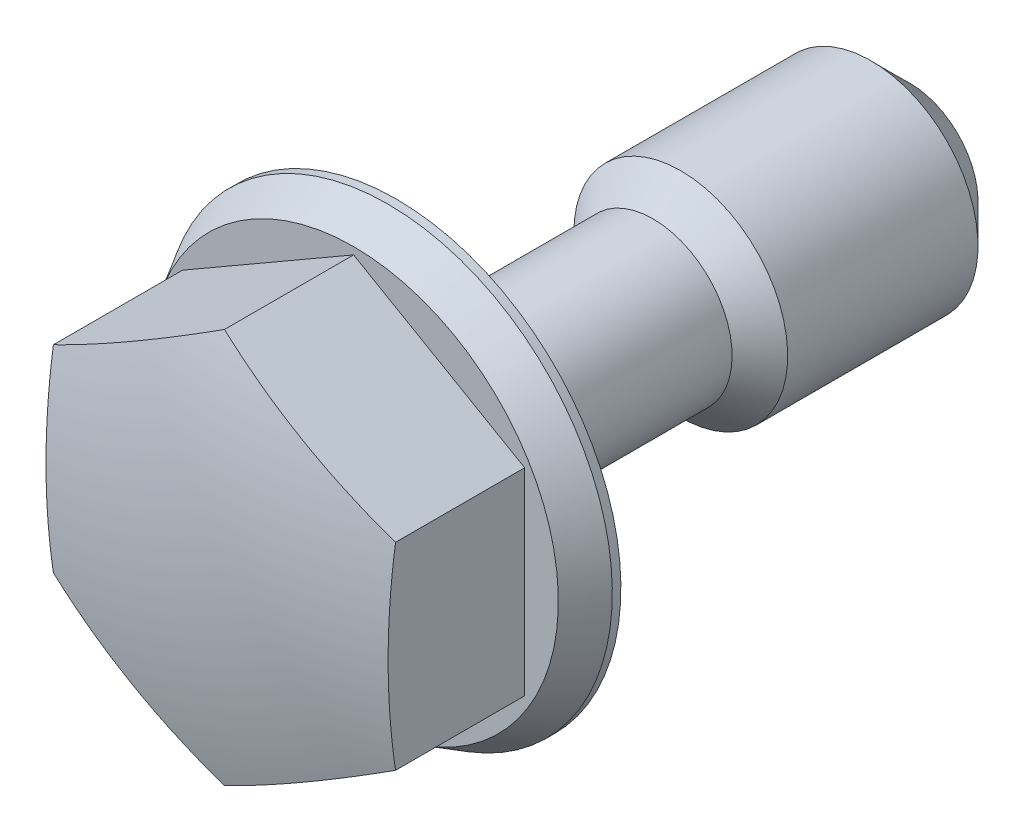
ISO-10303-21;
HEADER;
FILE_DESCRIPTION(('STEP AP214'),'2;1');
FILE_NAME('part.step','',(''),(''),'','','');
FILE_SCHEMA(('AUTOMOTIVE_DESIGN { 1 0 10303 214 1 1 1 1 }'));
ENDSEC;
DATA;
#1=APPLICATION_CONTEXT('core data for automotive mechanical design processes');
#2=APPLICATION_PROTOCOL_DEFINITION('international standard','automotive_design',2000,#1);
#3=PRODUCT_CONTEXT('',#1,'mechanical');
#4=PRODUCT('Part','Part','',(#3));
#5=PRODUCT_RELATED_PRODUCT_CATEGORY('part','',(#4));
#6=PRODUCT_DEFINITION_FORMATION('','',#4);
#7=PRODUCT_DEFINITION_CONTEXT('part definition',#1,'design');
#8=PRODUCT_DEFINITION('design','',#6,#7);
#9=PRODUCT_DEFINITION_SHAPE('','',#8);
#10=(LENGTH_UNIT() NAMED_UNIT(*) SI_UNIT(.MILLI.,.METRE.));
#11=(NAMED_UNIT(*) PLANE_ANGLE_UNIT() SI_UNIT($,.RADIAN.));
#12=(NAMED_UNIT(*) SI_UNIT($,.STERADIAN.) SOLID_ANGLE_UNIT());
#13=UNCERTAINTY_MEASURE_WITH_UNIT(LENGTH_MEASURE(1.E-05),#10,'distance_accuracy_value','');
#14=(GEOMETRIC_REPRESENTATION_CONTEXT(3) GLOBAL_UNCERTAINTY_ASSIGNED_CONTEXT((#13)) GLOBAL_UNIT_ASSIGNED_CONTEXT((#10,
#11,#12)) REPRESENTATION_CONTEXT('',''));
#15=CARTESIAN_POINT('',(0.,0.,0.));
#16=DIRECTION('',(0.,0.,1.));
#17=DIRECTION('',(1.,0.,0.));
#18=AXIS2_PLACEMENT_3D('',#15,#16,#17);
#19=CARTESIAN_POINT('',(0.,0.,1.));
#20=DIRECTION('',(0.,0.,-1.));
#21=DIRECTION('',(0.,1.,0.));
#22=AXIS2_PLACEMENT_3D('',#19,#20,#21);
#23=CONICAL_SURFACE('',#22,4.7881197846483,0.523598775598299);
#24=CARTESIAN_POINT('',(0.,0.,0.2));
#25=DIRECTION('',(0.,0.,-1.));
#26=DIRECTION('',(0.,1.,0.));
#27=AXIS2_PLACEMENT_3D('',#24,#25,#26);
#28=CIRCLE('',#27,5.25);
#29=CARTESIAN_POINT('',(0.,5.25,0.2));
#30=VERTEX_POINT('',#29);
#31=EDGE_CURVE('E117',#30,#30,#28,.T.);
#32=ORIENTED_EDGE('',*,*,#31,.F.);
#33=EDGE_LOOP('',(#32));
#34=FACE_BOUND('',#33,.T.);
#35=CARTESIAN_POINT('',(0.,0.,1.));
#36=DIRECTION('',(0.,0.,1.));
#37=DIRECTION('',(0.,-1.,0.));
#38=AXIS2_PLACEMENT_3D('',#35,#36,#37);
#39=CIRCLE('',#38,4.7881197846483);
#40=CARTESIAN_POINT('',(0.,-4.7881197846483,1.));
#41=VERTEX_POINT('',#40);
#42=EDGE_CURVE('E95',#41,#41,#39,.T.);
#43=ORIENTED_EDGE('',*,*,#42,.F.);
#44=EDGE_LOOP('',(#43));
#45=FACE_BOUND('',#44,.T.);
#46=ADVANCED_FACE('F14',(#34,#45),#23,.T.);
#47=CARTESIAN_POINT('',(0.,0.,-12.));
#48=DIRECTION('',(0.,0.,-1.));
#49=DIRECTION('',(0.,1.,0.));
#50=AXIS2_PLACEMENT_3D('',#47,#48,#49);
#51=CYLINDRICAL_SURFACE('',#50,5.25);
#52=CARTESIAN_POINT('',(0.,0.,0.));
#53=DIRECTION('',(0.,0.,-1.));
#54=DIRECTION('',(0.,1.,0.));
#55=AXIS2_PLACEMENT_3D('',#52,#53,#54);
#56=CIRCLE('',#55,5.25);
#57=CARTESIAN_POINT('',(0.,5.25,0.));
#58=VERTEX_POINT('',#57);
#59=EDGE_CURVE('E114',#58,#58,#56,.T.);
#60=ORIENTED_EDGE('',*,*,#59,.F.);
#61=EDGE_LOOP('',(#60));
#62=FACE_BOUND('',#61,.T.);
#63=ORIENTED_EDGE('',*,*,#31,.T.);
#64=EDGE_LOOP('',(#63));
#65=FACE_BOUND('',#64,.T.);
#66=ADVANCED_FACE('F150',(#62,#65),#51,.T.);
#67=CARTESIAN_POINT('',(5.25,0.,0.));
#68=DIRECTION('',(0.,0.,1.));
#69=DIRECTION('',(0.,-1.,0.));
#70=AXIS2_PLACEMENT_3D('',#67,#68,#69);
#71=PLANE('',#70);
#72=CARTESIAN_POINT('',(0.,0.,0.));
#73=DIRECTION('',(0.,0.,-1.));
#74=DIRECTION('',(0.,1.,0.));
#75=AXIS2_PLACEMENT_3D('',#72,#73,#74);
#76=CIRCLE('',#75,2.45);
#77=CARTESIAN_POINT('',(0.,2.45,0.));
#78=VERTEX_POINT('',#77);
#79=EDGE_CURVE('E111',#78,#78,#76,.T.);
#80=ORIENTED_EDGE('',*,*,#79,.F.);
#81=EDGE_LOOP('',(#80));
#82=FACE_BOUND('',#81,.T.);
#83=ORIENTED_EDGE('',*,*,#59,.T.);
#84=EDGE_LOOP('',(#83));
#85=FACE_BOUND('',#84,.T.);
#86=ADVANCED_FACE('F156',(#82,#85),#71,.F.);
#87=CARTESIAN_POINT('',(0.,0.,-0.6));
#88=DIRECTION('',(0.,0.,-1.));
#89=DIRECTION('',(0.,1.,0.));
#90=AXIS2_PLACEMENT_3D('',#87,#88,#89);
#91=TOROIDAL_SURFACE('',#90,2.45,0.6);
#92=CARTESIAN_POINT('',(0.,0.,-0.6));
#93=DIRECTION('',(0.,0.,-1.));
#94=DIRECTION('',(0.,1.,0.));
#95=AXIS2_PLACEMENT_3D('',#92,#93,#94);
#96=CIRCLE('',#95,1.85);
#97=CARTESIAN_POINT('',(0.,1.85,-0.6));
#98=VERTEX_POINT('',#97);
#99=EDGE_CURVE('E108',#98,#98,#96,.T.);
#100=ORIENTED_EDGE('',*,*,#99,.F.);
#101=EDGE_LOOP('',(#100));
#102=FACE_BOUND('',#101,.T.);
#103=ORIENTED_EDGE('',*,*,#79,.T.);
#104=EDGE_LOOP('',(#103));
#105=FACE_BOUND('',#104,.T.);
#106=ADVANCED_FACE('F215',(#102,#105),#91,.F.);
#107=CARTESIAN_POINT('',(0.,0.,-12.));
#108=DIRECTION('',(0.,0.,-1.));
#109=DIRECTION('',(0.,1.,0.));
#110=AXIS2_PLACEMENT_3D('',#107,#108,#109);
#111=CYLINDRICAL_SURFACE('',#110,1.85);
#112=CARTESIAN_POINT('',(0.,0.,-6.));
#113=DIRECTION('',(0.,0.,-1.));
#114=DIRECTION('',(0.,1.,0.));
#115=AXIS2_PLACEMENT_3D('',#112,#113,#114);
#116=CIRCLE('',#115,1.85);
#117=CARTESIAN_POINT('',(0.,1.85,-6.));
#118=VERTEX_POINT('',#117);
#119=EDGE_CURVE('E83',#118,#118,#116,.T.);
#120=ORIENTED_EDGE('',*,*,#119,.F.);
#121=EDGE_LOOP('',(#120));
#122=FACE_BOUND('',#121,.T.);
#123=ORIENTED_EDGE('',*,*,#99,.T.);
#124=EDGE_LOOP('',(#123));
#125=FACE_BOUND('',#124,.T.);
#126=ADVANCED_FACE('F212',(#122,#125),#111,.T.);
#127=CARTESIAN_POINT('',(0.,0.,1.));
#128=DIRECTION('',(0.,0.,1.));
#129=DIRECTION('',(0.,-1.,0.));
#130=AXIS2_PLACEMENT_3D('',#127,#128,#129);
#131=PLANE('',#130);
#132=DIRECTION('',(0.,-1.,0.));
#133=VECTOR('',#132,1.);
#134=CARTESIAN_POINT('',(-4.,2.30940107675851,1.));
#135=LINE('',#134,#133);
#136=CARTESIAN_POINT('',(-4.,2.30940107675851,1.));
#137=VERTEX_POINT('',#136);
#138=CARTESIAN_POINT('',(-4.,-2.30940107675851,1.));
#139=VERTEX_POINT('',#138);
#140=EDGE_CURVE('E72',#137,#139,#135,.T.);
#141=ORIENTED_EDGE('',*,*,#140,.F.);
#142=DIRECTION('',(-0.866025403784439,-0.5,0.));
#143=VECTOR('',#142,1.);
#144=CARTESIAN_POINT('',(0.,4.61880215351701,1.));
#145=LINE('',#144,#143);
#146=CARTESIAN_POINT('',(0.,4.61880215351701,1.));
#147=VERTEX_POINT('',#146);
#148=EDGE_CURVE('E88',#147,#137,#145,.T.);
#149=ORIENTED_EDGE('',*,*,#148,.F.);
#150=DIRECTION('',(-0.866025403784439,0.5,0.));
#151=VECTOR('',#150,1.);
#152=CARTESIAN_POINT('',(4.,2.30940107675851,1.));
#153=LINE('',#152,#151);
#154=CARTESIAN_POINT('',(4.,2.30940107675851,1.));
#155=VERTEX_POINT('',#154);
#156=EDGE_CURVE('E90',#155,#147,#153,.T.);
#157=ORIENTED_EDGE('',*,*,#156,.F.);
#158=DIRECTION('',(0.,1.,0.));
#159=VECTOR('',#158,1.);
#160=CARTESIAN_POINT('',(4.,-2.30940107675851,1.));
#161=LINE('',#160,#159);
#162=CARTESIAN_POINT('',(4.,-2.30940107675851,1.));
#163=VERTEX_POINT('',#162);
#164=EDGE_CURVE('E183',#163,#155,#161,.T.);
#165=ORIENTED_EDGE('',*,*,#164,.F.);
#166=DIRECTION('',(0.866025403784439,0.5,0.));
#167=VECTOR('',#166,1.);
#168=CARTESIAN_POINT('',(0.,-4.61880215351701,1.));
#169=LINE('',#168,#167);
#170=CARTESIAN_POINT('',(0.,-4.61880215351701,1.));
#171=VERTEX_POINT('',#170);
#172=EDGE_CURVE('E82',#171,#163,#169,.T.);
#173=ORIENTED_EDGE('',*,*,#172,.F.);
#174=DIRECTION('',(0.866025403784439,-0.5,0.));
#175=VECTOR('',#174,1.);
#176=CARTESIAN_POINT('',(-4.,-2.30940107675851,1.));
#177=LINE('',#176,#175);
#178=EDGE_CURVE('E68',#139,#171,#177,.T.);
#179=ORIENTED_EDGE('',*,*,#178,.F.);
#180=EDGE_LOOP('',(#141,#149,#157,#165,#173,#179));
#181=FACE_BOUND('',#180,.T.);
#182=ORIENTED_EDGE('',*,*,#42,.T.);
#183=EDGE_LOOP('',(#182));
#184=FACE_BOUND('',#183,.T.);
#185=ADVANCED_FACE('F77',(#181,#184),#131,.T.);
#186=CARTESIAN_POINT('',(-4.,2.30940107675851,1.));
#187=DIRECTION('',(-1.,0.,0.));
#188=DIRECTION('',(0.,-1.,0.));
#189=AXIS2_PLACEMENT_3D('',#186,#187,#188);
#190=PLANE('',#189);
#191=DIRECTION('',(0.,0.,1.));
#192=VECTOR('',#191,1.);
#193=CARTESIAN_POINT('',(-4.,2.30940107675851,1.));
#194=LINE('',#193,#192);
#195=CARTESIAN_POINT('',(-4.,2.30940107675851,4.0188337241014));
#196=VERTEX_POINT('',#195);
#197=EDGE_CURVE('E86',#137,#196,#194,.T.);
#198=ORIENTED_EDGE('',*,*,#197,.F.);
#199=ORIENTED_EDGE('',*,*,#140,.T.);
#200=DIRECTION('',(0.,0.,1.));
#201=VECTOR('',#200,1.);
#202=CARTESIAN_POINT('',(-4.,-2.30940107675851,1.));
#203=LINE('',#202,#201);
#204=CARTESIAN_POINT('',(-4.,-2.30940107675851,4.0188337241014));
#205=VERTEX_POINT('',#204);
#206=EDGE_CURVE('E65',#139,#205,#203,.T.);
#207=ORIENTED_EDGE('',*,*,#206,.T.);
#208=CARTESIAN_POINT('',(-4.,0.,-11.3));
#209=DIRECTION('',(-1.,0.,0.));
#210=DIRECTION('',(0.,-1.,0.));
#211=AXIS2_PLACEMENT_3D('',#208,#209,#210);
#212=CIRCLE('',#211,15.4919333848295);
#213=EDGE_CURVE('E37',#196,#205,#212,.F.);
#214=ORIENTED_EDGE('',*,*,#213,.F.);
#215=EDGE_LOOP('',(#198,#199,#207,#214));
#216=FACE_BOUND('',#215,.T.);
#217=ADVANCED_FACE('F85',(#216),#190,.T.);
#218=CARTESIAN_POINT('',(0.,4.61880215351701,1.));
#219=DIRECTION('',(-0.5,0.866025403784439,0.));
#220=DIRECTION('',(-0.866025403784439,-0.5,0.));
#221=AXIS2_PLACEMENT_3D('',#218,#219,#220);
#222=PLANE('',#221);
#223=DIRECTION('',(0.,0.,1.));
#224=VECTOR('',#223,1.);
#225=CARTESIAN_POINT('',(0.,4.61880215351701,1.));
#226=LINE('',#225,#224);
#227=CARTESIAN_POINT('',(0.,4.61880215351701,4.01883372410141));
#228=VERTEX_POINT('',#227);
#229=EDGE_CURVE('E96',#147,#228,#226,.T.);
#230=ORIENTED_EDGE('',*,*,#229,.F.);
#231=ORIENTED_EDGE('',*,*,#148,.T.);
#232=ORIENTED_EDGE('',*,*,#197,.T.);
#233=CARTESIAN_POINT('',(-2.,3.46410161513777,-11.3));
#234=DIRECTION('',(-0.5,0.866025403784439,0.));
#235=DIRECTION('',(-0.866025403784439,-0.5,0.));
#236=AXIS2_PLACEMENT_3D('',#233,#234,#235);
#237=CIRCLE('',#236,15.4919333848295);
#238=EDGE_CURVE('E130',#228,#196,#237,.F.);
#239=ORIENTED_EDGE('',*,*,#238,.F.);
#240=EDGE_LOOP('',(#230,#231,#232,#239));
#241=FACE_BOUND('',#240,.T.);
#242=ADVANCED_FACE('F195',(#241),#222,.T.);
#243=CARTESIAN_POINT('',(4.,2.30940107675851,1.));
#244=DIRECTION('',(0.5,0.866025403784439,0.));
#245=DIRECTION('',(-0.866025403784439,0.5,0.));
#246=AXIS2_PLACEMENT_3D('',#243,#244,#245);
#247=PLANE('',#246);
#248=DIRECTION('',(0.,0.,1.));
#249=VECTOR('',#248,1.);
#250=CARTESIAN_POINT('',(4.,2.30940107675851,1.));
#251=LINE('',#250,#249);
#252=CARTESIAN_POINT('',(4.,2.30940107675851,4.01883372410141));
#253=VERTEX_POINT('',#252);
#254=EDGE_CURVE('E99',#155,#253,#251,.T.);
#255=ORIENTED_EDGE('',*,*,#254,.F.);
#256=ORIENTED_EDGE('',*,*,#156,.T.);
#257=ORIENTED_EDGE('',*,*,#229,.T.);
#258=CARTESIAN_POINT('',(2.,3.46410161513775,-11.3));
#259=DIRECTION('',(0.5,0.866025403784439,0.));
#260=DIRECTION('',(-0.866025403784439,0.5,0.));
#261=AXIS2_PLACEMENT_3D('',#258,#259,#260);
#262=CIRCLE('',#261,15.4919333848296);
#263=EDGE_CURVE('E127',#253,#228,#262,.F.);
#264=ORIENTED_EDGE('',*,*,#263,.F.);
#265=EDGE_LOOP('',(#255,#256,#257,#264));
#266=FACE_BOUND('',#265,.T.);
#267=ADVANCED_FACE('F188',(#266),#247,.T.);
#268=CARTESIAN_POINT('',(4.,-2.30940107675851,1.));
#269=DIRECTION('',(1.,0.,0.));
#270=DIRECTION('',(0.,1.,0.));
#271=AXIS2_PLACEMENT_3D('',#268,#269,#270);
#272=PLANE('',#271);
#273=DIRECTION('',(0.,0.,1.));
#274=VECTOR('',#273,1.);
#275=CARTESIAN_POINT('',(4.,-2.30940107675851,1.));
#276=LINE('',#275,#274);
#277=CARTESIAN_POINT('',(4.,-2.30940107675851,4.01883372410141));
#278=VERTEX_POINT('',#277);
#279=EDGE_CURVE('E102',#163,#278,#276,.T.);
#280=ORIENTED_EDGE('',*,*,#279,.F.);
#281=ORIENTED_EDGE('',*,*,#164,.T.);
#282=ORIENTED_EDGE('',*,*,#254,.T.);
#283=CARTESIAN_POINT('',(4.,0.,-11.3));
#284=DIRECTION('',(1.,0.,0.));
#285=DIRECTION('',(0.,1.,0.));
#286=AXIS2_PLACEMENT_3D('',#283,#284,#285);
#287=CIRCLE('',#286,15.4919333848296);
#288=EDGE_CURVE('E124',#278,#253,#287,.F.);
#289=ORIENTED_EDGE('',*,*,#288,.F.);
#290=EDGE_LOOP('',(#280,#281,#282,#289));
#291=FACE_BOUND('',#290,.T.);
#292=ADVANCED_FACE('F191',(#291),#272,.T.);
#293=CARTESIAN_POINT('',(0.,-4.61880215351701,1.));
#294=DIRECTION('',(0.5,-0.866025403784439,0.));
#295=DIRECTION('',(0.866025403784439,0.5,0.));
#296=AXIS2_PLACEMENT_3D('',#293,#294,#295);
#297=PLANE('',#296);
#298=DIRECTION('',(0.,0.,1.));
#299=VECTOR('',#298,1.);
#300=CARTESIAN_POINT('',(0.,-4.61880215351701,1.));
#301=LINE('',#300,#299);
#302=CARTESIAN_POINT('',(0.,-4.61880215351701,4.01883372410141));
#303=VERTEX_POINT('',#302);
#304=EDGE_CURVE('E29',#171,#303,#301,.T.);
#305=ORIENTED_EDGE('',*,*,#304,.F.);
#306=ORIENTED_EDGE('',*,*,#172,.T.);
#307=ORIENTED_EDGE('',*,*,#279,.T.);
#308=CARTESIAN_POINT('',(2.,-3.46410161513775,-11.3));
#309=DIRECTION('',(0.5,-0.866025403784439,0.));
#310=DIRECTION('',(0.866025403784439,0.5,0.));
#311=AXIS2_PLACEMENT_3D('',#308,#309,#310);
#312=CIRCLE('',#311,15.4919333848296);
#313=EDGE_CURVE('E121',#303,#278,#312,.F.);
#314=ORIENTED_EDGE('',*,*,#313,.F.);
#315=EDGE_LOOP('',(#305,#306,#307,#314));
#316=FACE_BOUND('',#315,.T.);
#317=ADVANCED_FACE('F193',(#316),#297,.T.);
#318=CARTESIAN_POINT('',(-4.,-2.30940107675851,1.));
#319=DIRECTION('',(-0.5,-0.866025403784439,0.));
#320=DIRECTION('',(0.866025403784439,-0.5,0.));
#321=AXIS2_PLACEMENT_3D('',#318,#319,#320);
#322=PLANE('',#321);
#323=ORIENTED_EDGE('',*,*,#206,.F.);
#324=ORIENTED_EDGE('',*,*,#178,.T.);
#325=ORIENTED_EDGE('',*,*,#304,.T.);
#326=CARTESIAN_POINT('',(-2.,-3.46410161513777,-11.3));
#327=DIRECTION('',(-0.5,-0.866025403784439,0.));
#328=DIRECTION('',(0.866025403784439,-0.5,0.));
#329=AXIS2_PLACEMENT_3D('',#326,#327,#328);
#330=CIRCLE('',#329,15.4919333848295);
#331=EDGE_CURVE('E70',#205,#303,#330,.F.);
#332=ORIENTED_EDGE('',*,*,#331,.F.);
#333=EDGE_LOOP('',(#323,#324,#325,#332));
#334=FACE_BOUND('',#333,.T.);
#335=ADVANCED_FACE('F67',(#334),#322,.T.);
#336=CARTESIAN_POINT('',(0.,0.,-11.3));
#337=DIRECTION('',(0.,0.,-1.));
#338=DIRECTION('',(1.,0.,0.));
#339=AXIS2_PLACEMENT_3D('',#336,#337,#338);
#340=SPHERICAL_SURFACE('',#339,16.);
#341=ORIENTED_EDGE('',*,*,#263,.T.);
#342=ORIENTED_EDGE('',*,*,#238,.T.);
#343=ORIENTED_EDGE('',*,*,#213,.T.);
#344=ORIENTED_EDGE('',*,*,#331,.T.);
#345=ORIENTED_EDGE('',*,*,#313,.T.);
#346=ORIENTED_EDGE('',*,*,#288,.T.);
#347=EDGE_LOOP('',(#341,#342,#343,#344,#345,#346));
#348=FACE_BOUND('',#347,.T.);
#349=ADVANCED_FACE('F163',(#348),#340,.T.);
#350=CARTESIAN_POINT('',(0.,0.,-12.));
#351=DIRECTION('',(0.,0.,1.));
#352=DIRECTION('',(0.,-1.,0.));
#353=AXIS2_PLACEMENT_3D('',#350,#351,#352);
#354=CYLINDRICAL_SURFACE('',#353,2.5);
#355=CARTESIAN_POINT('',(0.,0.,-11.1));
#356=DIRECTION('',(0.,0.,-1.));
#357=DIRECTION('',(-1.,0.,0.));
#358=AXIS2_PLACEMENT_3D('',#355,#356,#357);
#359=CIRCLE('',#358,2.5);
#360=CARTESIAN_POINT('',(-2.5,0.,-11.1));
#361=VERTEX_POINT('',#360);
#362=EDGE_CURVE('E9',#361,#361,#359,.F.);
#363=ORIENTED_EDGE('',*,*,#362,.T.);
#364=EDGE_LOOP('',(#363));
#365=FACE_BOUND('',#364,.T.);
#366=CARTESIAN_POINT('',(0.,0.,-6.65));
#367=DIRECTION('',(0.,0.,-1.));
#368=DIRECTION('',(0.,1.,0.));
#369=AXIS2_PLACEMENT_3D('',#366,#367,#368);
#370=CIRCLE('',#369,2.5);
#371=CARTESIAN_POINT('',(0.,2.5,-6.65));
#372=VERTEX_POINT('',#371);
#373=EDGE_CURVE('E133',#372,#372,#370,.T.);
#374=ORIENTED_EDGE('',*,*,#373,.T.);
#375=EDGE_LOOP('',(#374));
#376=FACE_BOUND('',#375,.T.);
#377=ADVANCED_FACE('F165',(#365,#376),#354,.T.);
#378=CARTESIAN_POINT('',(0.,0.,-6.65));
#379=DIRECTION('',(0.,0.,-1.));
#380=DIRECTION('',(0.,1.,0.));
#381=AXIS2_PLACEMENT_3D('',#378,#379,#380);
#382=CONICAL_SURFACE('',#381,2.5,0.785398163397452);
#383=ORIENTED_EDGE('',*,*,#119,.T.);
#384=EDGE_LOOP('',(#383));
#385=FACE_BOUND('',#384,.T.);
#386=ORIENTED_EDGE('',*,*,#373,.F.);
#387=EDGE_LOOP('',(#386));
#388=FACE_BOUND('',#387,.T.);
#389=ADVANCED_FACE('F146',(#385,#388),#382,.T.);
#390=CARTESIAN_POINT('',(0.,0.,-12.));
#391=DIRECTION('',(0.,0.,-1.));
#392=DIRECTION('',(0.,1.,0.));
#393=AXIS2_PLACEMENT_3D('',#390,#391,#392);
#394=PLANE('',#393);
#395=CARTESIAN_POINT('',(0.,0.,-12.));
#396=DIRECTION('',(0.,0.,-1.));
#397=DIRECTION('',(-1.,0.,0.));
#398=AXIS2_PLACEMENT_3D('',#395,#396,#397);
#399=CIRCLE('',#398,1.6);
#400=CARTESIAN_POINT('',(-1.6,0.,-12.));
#401=VERTEX_POINT('',#400);
#402=EDGE_CURVE('E22',#401,#401,#399,.T.);
#403=ORIENTED_EDGE('',*,*,#402,.T.);
#404=EDGE_LOOP('',(#403));
#405=FACE_BOUND('',#404,.T.);
#406=ADVANCED_FACE('F138',(#405),#394,.T.);
#407=CARTESIAN_POINT('',(0.,0.,-12.));
#408=DIRECTION('',(0.,0.,1.));
#409=DIRECTION('',(1.,0.,0.));
#410=AXIS2_PLACEMENT_3D('',#407,#408,#409);
#411=CONICAL_SURFACE('',#410,1.6,0.785398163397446);
#412=ORIENTED_EDGE('',*,*,#362,.F.);
#413=EDGE_LOOP('',(#412));
#414=FACE_BOUND('',#413,.T.);
#415=ORIENTED_EDGE('',*,*,#402,.F.);
#416=EDGE_LOOP('',(#415));
#417=FACE_BOUND('',#416,.T.);
#418=ADVANCED_FACE('F16',(#414,#417),#411,.T.);
#419=CLOSED_SHELL('',(#46,#66,#86,#106,#126,#185,#217,#242,#267,#292,#317,#335,#349,#377,#389,
#406,#418));
#420=MANIFOLD_SOLID_BREP('B1',#419);
#421=ADVANCED_BREP_SHAPE_REPRESENTATION('',(#18,#420),#14);
#422=SHAPE_DEFINITION_REPRESENTATION(#9,#421);
ENDSEC;
END-ISO-10303-21;
